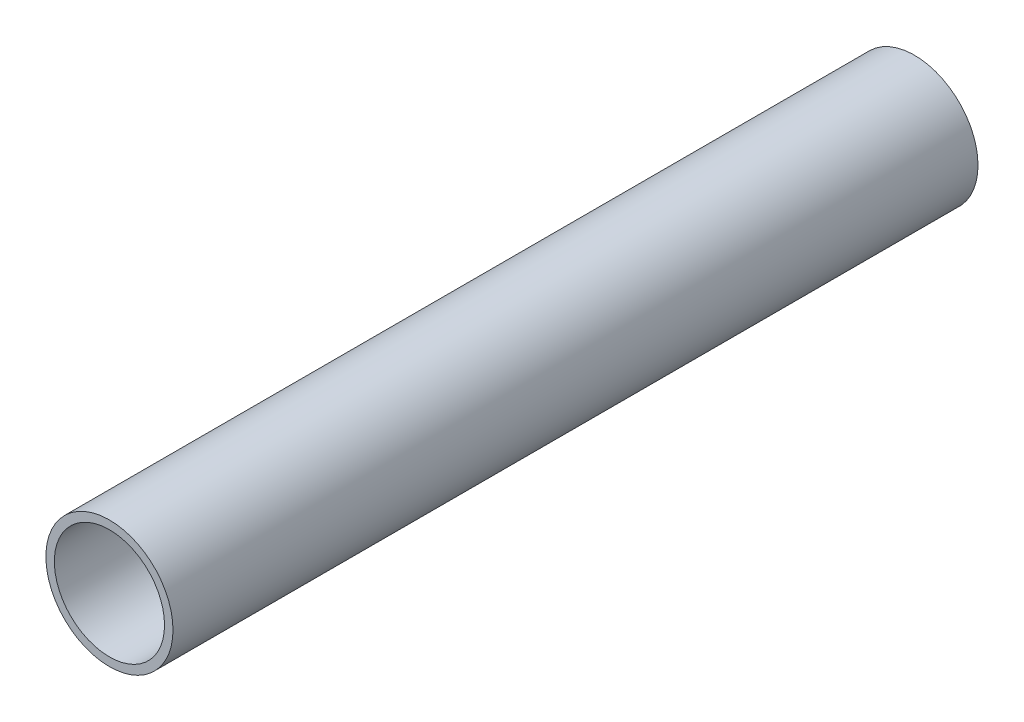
ISO-10303-21;
HEADER;
FILE_DESCRIPTION(('STEP AP214'),'2;1');
FILE_NAME('part.step','',(''),(''),'','','');
FILE_SCHEMA(('AUTOMOTIVE_DESIGN { 1 0 10303 214 1 1 1 1 }'));
ENDSEC;
DATA;
#1=APPLICATION_CONTEXT('core data for automotive mechanical design processes');
#2=APPLICATION_PROTOCOL_DEFINITION('international standard','automotive_design',2000,#1);
#3=PRODUCT_CONTEXT('',#1,'mechanical');
#4=PRODUCT('Part','Part','',(#3));
#5=PRODUCT_RELATED_PRODUCT_CATEGORY('part','',(#4));
#6=PRODUCT_DEFINITION_FORMATION('','',#4);
#7=PRODUCT_DEFINITION_CONTEXT('part definition',#1,'design');
#8=PRODUCT_DEFINITION('design','',#6,#7);
#9=PRODUCT_DEFINITION_SHAPE('','',#8);
#10=(LENGTH_UNIT() NAMED_UNIT(*) SI_UNIT(.MILLI.,.METRE.));
#11=(NAMED_UNIT(*) PLANE_ANGLE_UNIT() SI_UNIT($,.RADIAN.));
#12=(NAMED_UNIT(*) SI_UNIT($,.STERADIAN.) SOLID_ANGLE_UNIT());
#13=UNCERTAINTY_MEASURE_WITH_UNIT(LENGTH_MEASURE(1.E-05),#10,'distance_accuracy_value','');
#14=(GEOMETRIC_REPRESENTATION_CONTEXT(3) GLOBAL_UNCERTAINTY_ASSIGNED_CONTEXT((#13)) GLOBAL_UNIT_ASSIGNED_CONTEXT((#10,
#11,#12)) REPRESENTATION_CONTEXT('',''));
#15=CARTESIAN_POINT('',(0.,0.,0.));
#16=DIRECTION('',(0.,0.,1.));
#17=DIRECTION('',(1.,0.,0.));
#18=AXIS2_PLACEMENT_3D('',#15,#16,#17);
#19=CARTESIAN_POINT('',(0.,0.,-190.));
#20=DIRECTION('',(0.,0.,1.));
#21=DIRECTION('',(1.,0.,0.));
#22=AXIS2_PLACEMENT_3D('',#19,#20,#21);
#23=CYLINDRICAL_SURFACE('',#22,15.);
#24=CARTESIAN_POINT('',(0.,0.,-190.));
#25=DIRECTION('',(0.,0.,1.));
#26=DIRECTION('',(1.,0.,0.));
#27=AXIS2_PLACEMENT_3D('',#24,#25,#26);
#28=CIRCLE('',#27,15.);
#29=CARTESIAN_POINT('',(15.,0.,-190.));
#30=VERTEX_POINT('',#29);
#31=EDGE_CURVE('E10',#30,#30,#28,.T.);
#32=ORIENTED_EDGE('',*,*,#31,.T.);
#33=EDGE_LOOP('',(#32));
#34=FACE_BOUND('',#33,.T.);
#35=CARTESIAN_POINT('',(0.,0.,0.));
#36=DIRECTION('',(0.,0.,1.));
#37=DIRECTION('',(1.,0.,0.));
#38=AXIS2_PLACEMENT_3D('',#35,#36,#37);
#39=CIRCLE('',#38,15.);
#40=CARTESIAN_POINT('',(15.,0.,0.));
#41=VERTEX_POINT('',#40);
#42=EDGE_CURVE('E38',#41,#41,#39,.T.);
#43=ORIENTED_EDGE('',*,*,#42,.F.);
#44=EDGE_LOOP('',(#43));
#45=FACE_BOUND('',#44,.T.);
#46=ADVANCED_FACE('F35',(#34,#45),#23,.T.);
#47=CARTESIAN_POINT('',(0.,0.,-190.));
#48=DIRECTION('',(0.,0.,1.));
#49=DIRECTION('',(1.,0.,0.));
#50=AXIS2_PLACEMENT_3D('',#47,#48,#49);
#51=PLANE('',#50);
#52=CARTESIAN_POINT('',(0.,0.,-190.));
#53=DIRECTION('',(0.,0.,1.));
#54=DIRECTION('',(1.,0.,0.));
#55=AXIS2_PLACEMENT_3D('',#52,#53,#54);
#56=CIRCLE('',#55,13.);
#57=CARTESIAN_POINT('',(13.,0.,-190.));
#58=VERTEX_POINT('',#57);
#59=EDGE_CURVE('E45',#58,#58,#56,.T.);
#60=ORIENTED_EDGE('',*,*,#59,.T.);
#61=EDGE_LOOP('',(#60));
#62=FACE_BOUND('',#61,.T.);
#63=ORIENTED_EDGE('',*,*,#31,.F.);
#64=EDGE_LOOP('',(#63));
#65=FACE_BOUND('',#64,.T.);
#66=ADVANCED_FACE('F53',(#62,#65),#51,.F.);
#67=CARTESIAN_POINT('',(0.,0.,0.));
#68=DIRECTION('',(0.,0.,1.));
#69=DIRECTION('',(1.,0.,0.));
#70=AXIS2_PLACEMENT_3D('',#67,#68,#69);
#71=PLANE('',#70);
#72=CARTESIAN_POINT('',(0.,0.,0.));
#73=DIRECTION('',(0.,0.,1.));
#74=DIRECTION('',(1.,0.,0.));
#75=AXIS2_PLACEMENT_3D('',#72,#73,#74);
#76=CIRCLE('',#75,13.);
#77=CARTESIAN_POINT('',(13.,0.,0.));
#78=VERTEX_POINT('',#77);
#79=EDGE_CURVE('E47',#78,#78,#76,.T.);
#80=ORIENTED_EDGE('',*,*,#79,.F.);
#81=EDGE_LOOP('',(#80));
#82=FACE_BOUND('',#81,.T.);
#83=ORIENTED_EDGE('',*,*,#42,.T.);
#84=EDGE_LOOP('',(#83));
#85=FACE_BOUND('',#84,.T.);
#86=ADVANCED_FACE('F59',(#82,#85),#71,.T.);
#87=CARTESIAN_POINT('',(0.,0.,-190.));
#88=DIRECTION('',(0.,0.,1.));
#89=DIRECTION('',(1.,0.,0.));
#90=AXIS2_PLACEMENT_3D('',#87,#88,#89);
#91=CYLINDRICAL_SURFACE('',#90,13.);
#92=ORIENTED_EDGE('',*,*,#59,.F.);
#93=EDGE_LOOP('',(#92));
#94=FACE_BOUND('',#93,.T.);
#95=ORIENTED_EDGE('',*,*,#79,.T.);
#96=EDGE_LOOP('',(#95));
#97=FACE_BOUND('',#96,.T.);
#98=ADVANCED_FACE('F56',(#94,#97),#91,.F.);
#99=CLOSED_SHELL('',(#46,#66,#86,#98));
#100=MANIFOLD_SOLID_BREP('B2',#99);
#101=ADVANCED_BREP_SHAPE_REPRESENTATION('',(#18,#100),#14);
#102=SHAPE_DEFINITION_REPRESENTATION(#9,#101);
ENDSEC;
END-ISO-10303-21;
